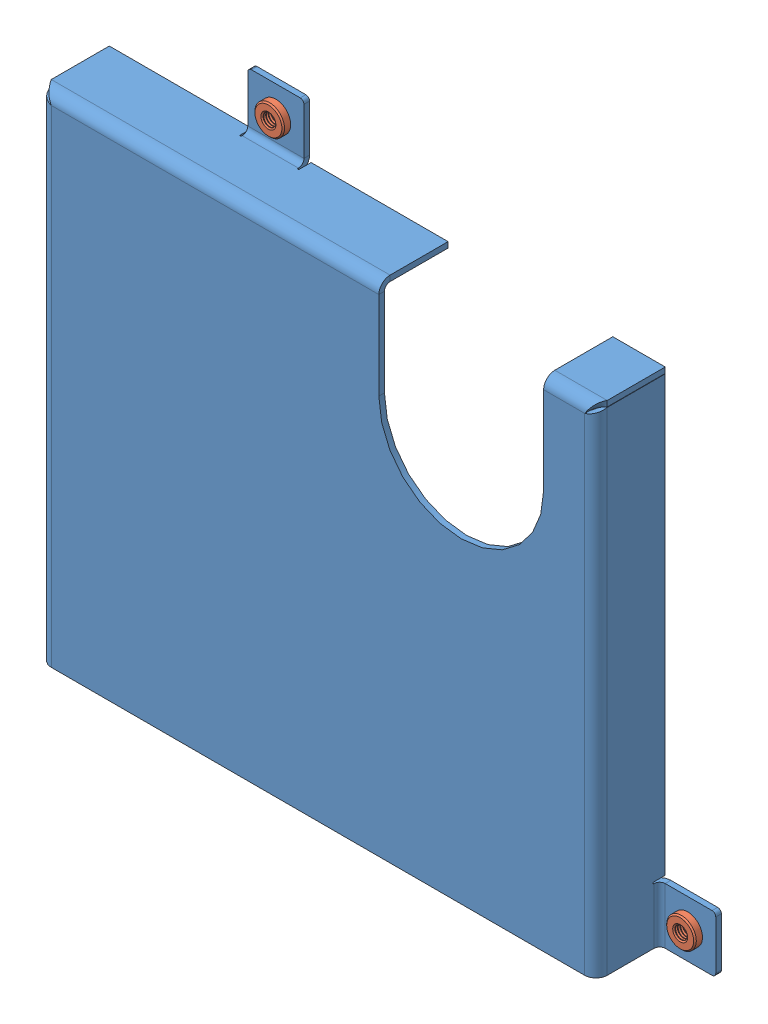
SolidWorks assembly 10643688-2.sldasm, configuration Standard (file format 3100). Lengths in mm.
Overall size (178.5 148 18.5).
4 component instances, 2 part files, 6 mates.
Components (placement in the parent):
- 10643688-2-1: 10643688-2.sldprt [Standard] at origin size (178.5 148 18.5)
- Self-clinching Nut_PMM-1: Self-clinching Nut_PMM.SLDPRT [PEM S-M4-2 ZI--S] at (-28.25 74.75 -15.5) x (1 0 0) z (0 -1 0) size (7.9 3.37 7.9)
- Self-clinching Nut_PMM-2: Self-clinching Nut_PMM.SLDPRT [PEM S-M4-2 ZI--S] at (-81.75 -58.25 -15.5) x (1 0 0) z (0 -1 0) size (7.9 3.37 7.9)
- Self-clinching Nut_PMM-3: Self-clinching Nut_PMM.SLDPRT [PEM S-M4-2 ZI--S] at (81.75 -58.25 -15.5) x (1 0 0) z (0 -1 0) size (7.9 3.37 7.9)
Mates (geometry in assembly coordinates):
- Deckungsgleich1: coincident anti-aligned: plane of 10643688-2-1 through (-35.75 67.25 -15.5) normal (0 0 1); plane of Self-clinching Nut_PMM-1
- Konzentrisch1: concentric anti-aligned: cylinder of 10643688-2-1; cylinder of Self-clinching Nut_PMM-1
- Deckungsgleich2: coincident anti-aligned: plane of 10643688-2-1 through (-74.25 -50.75 -15.5) normal (0 0 1); plane of Self-clinching Nut_PMM-2
- Konzentrisch2: concentric anti-aligned: cylinder of 10643688-2-1; cylinder of Self-clinching Nut_PMM-2
- Deckungsgleich3: coincident anti-aligned: plane of 10643688-2-1 through (74.25 -50.75 -15.5) normal (0 0 1); plane of Self-clinching Nut_PMM-3
- Konzentrisch3: concentric anti-aligned: cylinder of 10643688-2-1; cylinder of Self-clinching Nut_PMM-3
